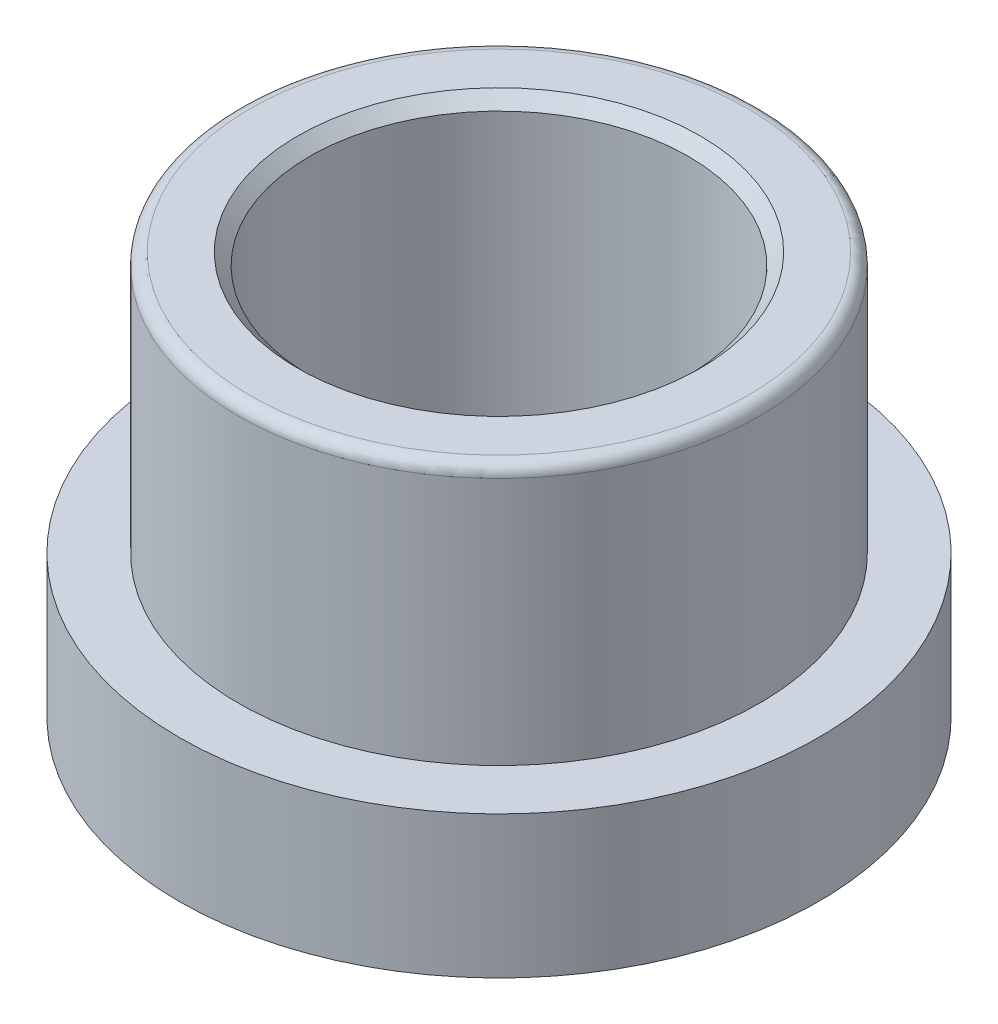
ISO-10303-21;
HEADER;
FILE_DESCRIPTION(('STEP AP214'),'2;1');
FILE_NAME('part.step','',(''),(''),'','','');
FILE_SCHEMA(('AUTOMOTIVE_DESIGN { 1 0 10303 214 1 1 1 1 }'));
ENDSEC;
DATA;
#1=APPLICATION_CONTEXT('core data for automotive mechanical design processes');
#2=APPLICATION_PROTOCOL_DEFINITION('international standard','automotive_design',2000,#1);
#3=PRODUCT_CONTEXT('',#1,'mechanical');
#4=PRODUCT('Part','Part','',(#3));
#5=PRODUCT_RELATED_PRODUCT_CATEGORY('part','',(#4));
#6=PRODUCT_DEFINITION_FORMATION('','',#4);
#7=PRODUCT_DEFINITION_CONTEXT('part definition',#1,'design');
#8=PRODUCT_DEFINITION('design','',#6,#7);
#9=PRODUCT_DEFINITION_SHAPE('','',#8);
#10=(LENGTH_UNIT() NAMED_UNIT(*) SI_UNIT(.MILLI.,.METRE.));
#11=(NAMED_UNIT(*) PLANE_ANGLE_UNIT() SI_UNIT($,.RADIAN.));
#12=(NAMED_UNIT(*) SI_UNIT($,.STERADIAN.) SOLID_ANGLE_UNIT());
#13=UNCERTAINTY_MEASURE_WITH_UNIT(LENGTH_MEASURE(1.E-05),#10,'distance_accuracy_value','');
#14=(GEOMETRIC_REPRESENTATION_CONTEXT(3) GLOBAL_UNCERTAINTY_ASSIGNED_CONTEXT((#13)) GLOBAL_UNIT_ASSIGNED_CONTEXT((#10,
#11,#12)) REPRESENTATION_CONTEXT('',''));
#15=CARTESIAN_POINT('',(0.,0.,0.));
#16=DIRECTION('',(0.,0.,1.));
#17=DIRECTION('',(1.,0.,0.));
#18=AXIS2_PLACEMENT_3D('',#15,#16,#17);
#19=CARTESIAN_POINT('',(0.,0.,0.));
#20=DIRECTION('',(0.,-1.,0.));
#21=DIRECTION('',(0.,0.,-1.));
#22=AXIS2_PLACEMENT_3D('',#19,#20,#21);
#23=CYLINDRICAL_SURFACE('',#22,11.);
#24=CARTESIAN_POINT('',(0.,10.5,0.));
#25=DIRECTION('',(0.,-1.,0.));
#26=DIRECTION('',(0.,0.,-1.));
#27=AXIS2_PLACEMENT_3D('',#24,#25,#26);
#28=CIRCLE('',#27,11.);
#29=CARTESIAN_POINT('',(0.,10.5,-11.));
#30=VERTEX_POINT('',#29);
#31=EDGE_CURVE('E21',#30,#30,#28,.T.);
#32=ORIENTED_EDGE('',*,*,#31,.T.);
#33=EDGE_LOOP('',(#32));
#34=FACE_BOUND('',#33,.T.);
#35=CARTESIAN_POINT('',(0.,0.,0.));
#36=DIRECTION('',(0.,-1.,0.));
#37=DIRECTION('',(0.,0.,-1.));
#38=AXIS2_PLACEMENT_3D('',#35,#36,#37);
#39=CIRCLE('',#38,11.);
#40=CARTESIAN_POINT('',(0.,0.,-11.));
#41=VERTEX_POINT('',#40);
#42=EDGE_CURVE('E49',#41,#41,#39,.T.);
#43=ORIENTED_EDGE('',*,*,#42,.F.);
#44=EDGE_LOOP('',(#43));
#45=FACE_BOUND('',#44,.T.);
#46=ADVANCED_FACE('F14',(#34,#45),#23,.T.);
#47=CARTESIAN_POINT('',(-11.,11.,0.));
#48=DIRECTION('',(0.,-1.,0.));
#49=DIRECTION('',(0.,0.,-1.));
#50=AXIS2_PLACEMENT_3D('',#47,#48,#49);
#51=PLANE('',#50);
#52=CARTESIAN_POINT('',(0.,11.,0.));
#53=DIRECTION('',(0.,-1.,0.));
#54=DIRECTION('',(0.,0.,-1.));
#55=AXIS2_PLACEMENT_3D('',#52,#53,#54);
#56=CIRCLE('',#55,10.5);
#57=CARTESIAN_POINT('',(0.,11.,-10.5));
#58=VERTEX_POINT('',#57);
#59=EDGE_CURVE('E9',#58,#58,#56,.F.);
#60=ORIENTED_EDGE('',*,*,#59,.T.);
#61=EDGE_LOOP('',(#60));
#62=FACE_BOUND('',#61,.T.);
#63=CARTESIAN_POINT('',(0.,11.,0.));
#64=DIRECTION('',(0.,-1.,0.));
#65=DIRECTION('',(0.,0.,-1.));
#66=AXIS2_PLACEMENT_3D('',#63,#64,#65);
#67=CIRCLE('',#66,8.5);
#68=CARTESIAN_POINT('',(0.,11.,-8.5));
#69=VERTEX_POINT('',#68);
#70=EDGE_CURVE('E37',#69,#69,#67,.T.);
#71=ORIENTED_EDGE('',*,*,#70,.T.);
#72=EDGE_LOOP('',(#71));
#73=FACE_BOUND('',#72,.T.);
#74=ADVANCED_FACE('F56',(#62,#73),#51,.F.);
#75=CARTESIAN_POINT('',(0.,0.,0.));
#76=DIRECTION('',(0.,-1.,0.));
#77=DIRECTION('',(0.,0.,-1.));
#78=AXIS2_PLACEMENT_3D('',#75,#76,#77);
#79=CYLINDRICAL_SURFACE('',#78,8.);
#80=CARTESIAN_POINT('',(0.,10.5,0.));
#81=DIRECTION('',(0.,-1.,0.));
#82=DIRECTION('',(0.,0.,-1.));
#83=AXIS2_PLACEMENT_3D('',#80,#81,#82);
#84=CIRCLE('',#83,8.);
#85=CARTESIAN_POINT('',(0.,10.5,-8.));
#86=VERTEX_POINT('',#85);
#87=EDGE_CURVE('E34',#86,#86,#84,.F.);
#88=ORIENTED_EDGE('',*,*,#87,.T.);
#89=EDGE_LOOP('',(#88));
#90=FACE_BOUND('',#89,.T.);
#91=CARTESIAN_POINT('',(0.,-6.,0.));
#92=DIRECTION('',(0.,-1.,0.));
#93=DIRECTION('',(0.,0.,-1.));
#94=AXIS2_PLACEMENT_3D('',#91,#92,#93);
#95=CIRCLE('',#94,8.);
#96=CARTESIAN_POINT('',(0.,-6.,-8.));
#97=VERTEX_POINT('',#96);
#98=EDGE_CURVE('E40',#97,#97,#95,.T.);
#99=ORIENTED_EDGE('',*,*,#98,.T.);
#100=EDGE_LOOP('',(#99));
#101=FACE_BOUND('',#100,.T.);
#102=ADVANCED_FACE('F63',(#90,#101),#79,.F.);
#103=CARTESIAN_POINT('',(0.,-6.15,0.));
#104=DIRECTION('',(0.,-1.,0.));
#105=DIRECTION('',(0.,0.,-1.));
#106=AXIS2_PLACEMENT_3D('',#103,#104,#105);
#107=CONICAL_SURFACE('',#106,8.1,0.588002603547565);
#108=CARTESIAN_POINT('',(0.,-6.36,0.));
#109=DIRECTION('',(0.,1.,0.));
#110=DIRECTION('',(0.,0.,1.));
#111=AXIS2_PLACEMENT_3D('',#108,#109,#110);
#112=CIRCLE('',#111,8.24);
#113=CARTESIAN_POINT('',(0.,-6.36,8.24));
#114=VERTEX_POINT('',#113);
#115=EDGE_CURVE('E25',#114,#114,#112,.F.);
#116=ORIENTED_EDGE('',*,*,#115,.T.);
#117=EDGE_LOOP('',(#116));
#118=FACE_BOUND('',#117,.T.);
#119=ORIENTED_EDGE('',*,*,#98,.F.);
#120=EDGE_LOOP('',(#119));
#121=FACE_BOUND('',#120,.T.);
#122=ADVANCED_FACE('F82',(#118,#121),#107,.F.);
#123=CARTESIAN_POINT('',(-8.1,-6.,0.));
#124=DIRECTION('',(0.,1.,0.));
#125=DIRECTION('',(0.,0.,1.));
#126=AXIS2_PLACEMENT_3D('',#123,#124,#125);
#127=PLANE('',#126);
#128=CARTESIAN_POINT('',(0.,-6.,0.));
#129=DIRECTION('',(0.,1.,0.));
#130=DIRECTION('',(0.,0.,1.));
#131=AXIS2_PLACEMENT_3D('',#128,#129,#130);
#132=CIRCLE('',#131,8.6);
#133=CARTESIAN_POINT('',(0.,-6.,8.6));
#134=VERTEX_POINT('',#133);
#135=EDGE_CURVE('E29',#134,#134,#132,.T.);
#136=ORIENTED_EDGE('',*,*,#135,.T.);
#137=EDGE_LOOP('',(#136));
#138=FACE_BOUND('',#137,.T.);
#139=CARTESIAN_POINT('',(0.,-6.,0.));
#140=DIRECTION('',(0.,-1.,0.));
#141=DIRECTION('',(0.,0.,-1.));
#142=AXIS2_PLACEMENT_3D('',#139,#140,#141);
#143=CIRCLE('',#142,13.5);
#144=CARTESIAN_POINT('',(0.,-6.,-13.5));
#145=VERTEX_POINT('',#144);
#146=EDGE_CURVE('E43',#145,#145,#143,.T.);
#147=ORIENTED_EDGE('',*,*,#146,.T.);
#148=EDGE_LOOP('',(#147));
#149=FACE_BOUND('',#148,.T.);
#150=ADVANCED_FACE('F85',(#138,#149),#127,.F.);
#151=CARTESIAN_POINT('',(0.,0.,0.));
#152=DIRECTION('',(0.,-1.,0.));
#153=DIRECTION('',(0.,0.,-1.));
#154=AXIS2_PLACEMENT_3D('',#151,#152,#153);
#155=CYLINDRICAL_SURFACE('',#154,13.5);
#156=ORIENTED_EDGE('',*,*,#146,.F.);
#157=EDGE_LOOP('',(#156));
#158=FACE_BOUND('',#157,.T.);
#159=CARTESIAN_POINT('',(0.,0.,0.));
#160=DIRECTION('',(0.,-1.,0.));
#161=DIRECTION('',(0.,0.,-1.));
#162=AXIS2_PLACEMENT_3D('',#159,#160,#161);
#163=CIRCLE('',#162,13.5);
#164=CARTESIAN_POINT('',(0.,0.,-13.5));
#165=VERTEX_POINT('',#164);
#166=EDGE_CURVE('E46',#165,#165,#163,.T.);
#167=ORIENTED_EDGE('',*,*,#166,.T.);
#168=EDGE_LOOP('',(#167));
#169=FACE_BOUND('',#168,.T.);
#170=ADVANCED_FACE('F97',(#158,#169),#155,.T.);
#171=CARTESIAN_POINT('',(-13.5,0.,0.));
#172=DIRECTION('',(0.,-1.,0.));
#173=DIRECTION('',(0.,0.,-1.));
#174=AXIS2_PLACEMENT_3D('',#171,#172,#173);
#175=PLANE('',#174);
#176=ORIENTED_EDGE('',*,*,#166,.F.);
#177=EDGE_LOOP('',(#176));
#178=FACE_BOUND('',#177,.T.);
#179=ORIENTED_EDGE('',*,*,#42,.T.);
#180=EDGE_LOOP('',(#179));
#181=FACE_BOUND('',#180,.T.);
#182=ADVANCED_FACE('F53',(#178,#181),#175,.F.);
#183=CARTESIAN_POINT('',(0.,11.,0.));
#184=DIRECTION('',(0.,1.,0.));
#185=DIRECTION('',(0.,0.,1.));
#186=AXIS2_PLACEMENT_3D('',#183,#184,#185);
#187=CONICAL_SURFACE('',#186,8.5,0.785398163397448);
#188=ORIENTED_EDGE('',*,*,#87,.F.);
#189=EDGE_LOOP('',(#188));
#190=FACE_BOUND('',#189,.T.);
#191=ORIENTED_EDGE('',*,*,#70,.F.);
#192=EDGE_LOOP('',(#191));
#193=FACE_BOUND('',#192,.T.);
#194=ADVANCED_FACE('F67',(#190,#193),#187,.F.);
#195=CARTESIAN_POINT('',(0.,-6.5,0.));
#196=DIRECTION('',(0.,1.,0.));
#197=DIRECTION('',(0.,0.,1.));
#198=AXIS2_PLACEMENT_3D('',#195,#196,#197);
#199=CONICAL_SURFACE('',#198,8.1,0.785398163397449);
#200=ORIENTED_EDGE('',*,*,#135,.F.);
#201=EDGE_LOOP('',(#200));
#202=FACE_BOUND('',#201,.T.);
#203=ORIENTED_EDGE('',*,*,#115,.F.);
#204=EDGE_LOOP('',(#203));
#205=FACE_BOUND('',#204,.T.);
#206=ADVANCED_FACE('F69',(#202,#205),#199,.T.);
#207=CARTESIAN_POINT('',(0.,10.5,0.));
#208=DIRECTION('',(0.,-1.,0.));
#209=DIRECTION('',(0.,0.,-1.));
#210=AXIS2_PLACEMENT_3D('',#207,#208,#209);
#211=TOROIDAL_SURFACE('',#210,10.5,0.5);
#212=ORIENTED_EDGE('',*,*,#59,.F.);
#213=EDGE_LOOP('',(#212));
#214=FACE_BOUND('',#213,.T.);
#215=ORIENTED_EDGE('',*,*,#31,.F.);
#216=EDGE_LOOP('',(#215));
#217=FACE_BOUND('',#216,.T.);
#218=ADVANCED_FACE('F16',(#214,#217),#211,.T.);
#219=CLOSED_SHELL('',(#46,#74,#102,#122,#150,#170,#182,#194,#206,#218));
#220=MANIFOLD_SOLID_BREP('B1',#219);
#221=ADVANCED_BREP_SHAPE_REPRESENTATION('',(#18,#220),#14);
#222=SHAPE_DEFINITION_REPRESENTATION(#9,#221);
ENDSEC;
END-ISO-10303-21;
